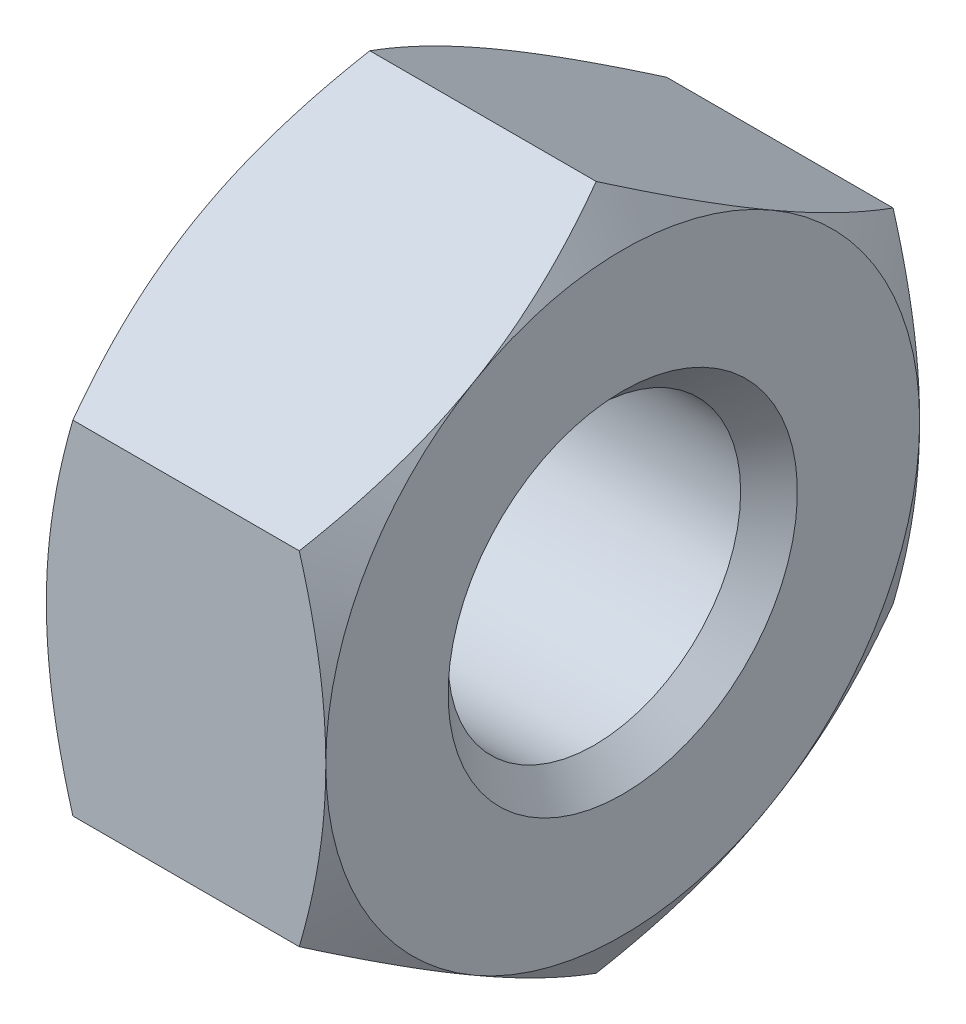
ISO-10303-21;
HEADER;
FILE_DESCRIPTION(('STEP AP214'),'2;1');
FILE_NAME('part.step','',(''),(''),'','','');
FILE_SCHEMA(('AUTOMOTIVE_DESIGN { 1 0 10303 214 1 1 1 1 }'));
ENDSEC;
DATA;
#1=APPLICATION_CONTEXT('core data for automotive mechanical design processes');
#2=APPLICATION_PROTOCOL_DEFINITION('international standard','automotive_design',2000,#1);
#3=PRODUCT_CONTEXT('',#1,'mechanical');
#4=PRODUCT('Part','Part','',(#3));
#5=PRODUCT_RELATED_PRODUCT_CATEGORY('part','',(#4));
#6=PRODUCT_DEFINITION_FORMATION('','',#4);
#7=PRODUCT_DEFINITION_CONTEXT('part definition',#1,'design');
#8=PRODUCT_DEFINITION('design','',#6,#7);
#9=PRODUCT_DEFINITION_SHAPE('','',#8);
#10=(LENGTH_UNIT() NAMED_UNIT(*) SI_UNIT(.MILLI.,.METRE.));
#11=(NAMED_UNIT(*) PLANE_ANGLE_UNIT() SI_UNIT($,.RADIAN.));
#12=(NAMED_UNIT(*) SI_UNIT($,.STERADIAN.) SOLID_ANGLE_UNIT());
#13=UNCERTAINTY_MEASURE_WITH_UNIT(LENGTH_MEASURE(1.E-05),#10,'distance_accuracy_value','');
#14=(GEOMETRIC_REPRESENTATION_CONTEXT(3) GLOBAL_UNCERTAINTY_ASSIGNED_CONTEXT((#13)) GLOBAL_UNIT_ASSIGNED_CONTEXT((#10,
#11,#12)) REPRESENTATION_CONTEXT('',''));
#15=CARTESIAN_POINT('',(0.,0.,0.));
#16=DIRECTION('',(0.,0.,1.));
#17=DIRECTION('',(1.,0.,0.));
#18=AXIS2_PLACEMENT_3D('',#15,#16,#17);
#19=DIRECTION('',(-0.707106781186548,0.707106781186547,0.));
#20=VECTOR('',#19,1.);
#21=CARTESIAN_POINT('',(-498995.,499000.,0.));
#22=LINE('',#21,#20);
#23=CARTESIAN_POINT('',(5.,0.,0.));
#24=DIRECTION('',(-1.,0.,0.));
#25=AXIS1_PLACEMENT('',#23,#24);
#26=SURFACE_OF_REVOLUTION('',#22,#25);
#27=CARTESIAN_POINT('',(0.812000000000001,0.,0.));
#28=DIRECTION('',(-1.,0.,0.));
#29=DIRECTION('',(0.,1.,0.));
#30=AXIS2_PLACEMENT_3D('',#27,#28,#29);
#31=CIRCLE('',#30,4.188);
#32=CARTESIAN_POINT('',(0.812000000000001,4.188,0.));
#33=VERTEX_POINT('',#32);
#34=EDGE_CURVE('E425',#33,#33,#31,.T.);
#35=ORIENTED_EDGE('',*,*,#34,.F.);
#36=EDGE_LOOP('',(#35));
#37=FACE_BOUND('',#36,.T.);
#38=CARTESIAN_POINT('',(0.,0.,0.));
#39=DIRECTION('',(-1.,0.,0.));
#40=DIRECTION('',(0.,1.,0.));
#41=AXIS2_PLACEMENT_3D('',#38,#39,#40);
#42=CIRCLE('',#41,5.);
#43=CARTESIAN_POINT('',(0.,5.,0.));
#44=VERTEX_POINT('',#43);
#45=EDGE_CURVE('E458',#44,#44,#42,.T.);
#46=ORIENTED_EDGE('',*,*,#45,.T.);
#47=EDGE_LOOP('',(#46));
#48=FACE_BOUND('',#47,.T.);
#49=ADVANCED_FACE('F16',(#37,#48),#26,.F.);
#50=CARTESIAN_POINT('',(0.,6.75,0.));
#51=DIRECTION('',(-1.,0.,0.));
#52=DIRECTION('',(0.,-1.,0.));
#53=AXIS2_PLACEMENT_3D('',#50,#51,#52);
#54=PLANE('',#53);
#55=CARTESIAN_POINT('',(0.,0.,0.));
#56=DIRECTION('',(-1.,0.,0.));
#57=DIRECTION('',(0.,1.,0.));
#58=AXIS2_PLACEMENT_3D('',#55,#56,#57);
#59=CIRCLE('',#58,8.5);
#60=CARTESIAN_POINT('',(0.,7.36121593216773,4.25));
#61=VERTEX_POINT('',#60);
#62=CARTESIAN_POINT('',(0.,7.36121593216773,-4.25));
#63=VERTEX_POINT('',#62);
#64=EDGE_CURVE('E11',#61,#63,#59,.T.);
#65=ORIENTED_EDGE('',*,*,#64,.T.);
#66=CARTESIAN_POINT('',(0.,0.,0.));
#67=DIRECTION('',(-1.,0.,0.));
#68=DIRECTION('',(0.,1.,0.));
#69=AXIS2_PLACEMENT_3D('',#66,#67,#68);
#70=CIRCLE('',#69,8.5);
#71=CARTESIAN_POINT('',(0.,0.,-8.5));
#72=VERTEX_POINT('',#71);
#73=EDGE_CURVE('E26',#63,#72,#70,.T.);
#74=ORIENTED_EDGE('',*,*,#73,.T.);
#75=CARTESIAN_POINT('',(0.,0.,0.));
#76=DIRECTION('',(-1.,0.,0.));
#77=DIRECTION('',(0.,1.,0.));
#78=AXIS2_PLACEMENT_3D('',#75,#76,#77);
#79=CIRCLE('',#78,8.5);
#80=CARTESIAN_POINT('',(0.,-7.36121593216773,-4.25));
#81=VERTEX_POINT('',#80);
#82=EDGE_CURVE('E160',#72,#81,#79,.T.);
#83=ORIENTED_EDGE('',*,*,#82,.T.);
#84=CARTESIAN_POINT('',(0.,0.,0.));
#85=DIRECTION('',(-1.,0.,0.));
#86=DIRECTION('',(0.,1.,0.));
#87=AXIS2_PLACEMENT_3D('',#84,#85,#86);
#88=CIRCLE('',#87,8.5);
#89=CARTESIAN_POINT('',(0.,-7.36121593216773,4.25));
#90=VERTEX_POINT('',#89);
#91=EDGE_CURVE('E362',#81,#90,#88,.T.);
#92=ORIENTED_EDGE('',*,*,#91,.T.);
#93=CARTESIAN_POINT('',(0.,0.,0.));
#94=DIRECTION('',(-1.,0.,0.));
#95=DIRECTION('',(0.,1.,0.));
#96=AXIS2_PLACEMENT_3D('',#93,#94,#95);
#97=CIRCLE('',#96,8.5);
#98=CARTESIAN_POINT('',(0.,0.,8.5));
#99=VERTEX_POINT('',#98);
#100=EDGE_CURVE('E365',#90,#99,#97,.T.);
#101=ORIENTED_EDGE('',*,*,#100,.T.);
#102=CARTESIAN_POINT('',(0.,0.,0.));
#103=DIRECTION('',(-1.,0.,0.));
#104=DIRECTION('',(0.,1.,0.));
#105=AXIS2_PLACEMENT_3D('',#102,#103,#104);
#106=CIRCLE('',#105,8.5);
#107=EDGE_CURVE('E361',#99,#61,#106,.T.);
#108=ORIENTED_EDGE('',*,*,#107,.T.);
#109=EDGE_LOOP('',(#65,#74,#83,#92,#101,#108));
#110=FACE_BOUND('',#109,.T.);
#111=ORIENTED_EDGE('',*,*,#45,.F.);
#112=EDGE_LOOP('',(#111));
#113=FACE_BOUND('',#112,.T.);
#114=ADVANCED_FACE('F179',(#110,#113),#54,.T.);
#115=CARTESIAN_POINT('',(8.,6.75,0.));
#116=DIRECTION('',(1.,0.,0.));
#117=DIRECTION('',(0.,0.,-1.));
#118=AXIS2_PLACEMENT_3D('',#115,#116,#117);
#119=PLANE('',#118);
#120=CARTESIAN_POINT('',(8.,0.,0.));
#121=DIRECTION('',(-1.,0.,0.));
#122=DIRECTION('',(0.,1.,0.));
#123=AXIS2_PLACEMENT_3D('',#120,#121,#122);
#124=CIRCLE('',#123,5.);
#125=CARTESIAN_POINT('',(8.,5.,0.));
#126=VERTEX_POINT('',#125);
#127=EDGE_CURVE('E355',#126,#126,#124,.T.);
#128=ORIENTED_EDGE('',*,*,#127,.T.);
#129=EDGE_LOOP('',(#128));
#130=FACE_BOUND('',#129,.T.);
#131=CARTESIAN_POINT('',(8.,0.,0.));
#132=DIRECTION('',(-1.,0.,0.));
#133=DIRECTION('',(0.,1.,0.));
#134=AXIS2_PLACEMENT_3D('',#131,#132,#133);
#135=CIRCLE('',#134,8.5);
#136=CARTESIAN_POINT('',(8.,7.36121593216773,4.25));
#137=VERTEX_POINT('',#136);
#138=CARTESIAN_POINT('',(8.,7.36121593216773,-4.25));
#139=VERTEX_POINT('',#138);
#140=EDGE_CURVE('E371',#137,#139,#135,.T.);
#141=ORIENTED_EDGE('',*,*,#140,.F.);
#142=CARTESIAN_POINT('',(8.,0.,0.));
#143=DIRECTION('',(-1.,0.,0.));
#144=DIRECTION('',(0.,1.,0.));
#145=AXIS2_PLACEMENT_3D('',#142,#143,#144);
#146=CIRCLE('',#145,8.5);
#147=CARTESIAN_POINT('',(8.,0.,8.5));
#148=VERTEX_POINT('',#147);
#149=EDGE_CURVE('E407',#148,#137,#146,.T.);
#150=ORIENTED_EDGE('',*,*,#149,.F.);
#151=CARTESIAN_POINT('',(8.,0.,0.));
#152=DIRECTION('',(-1.,0.,0.));
#153=DIRECTION('',(0.,1.,0.));
#154=AXIS2_PLACEMENT_3D('',#151,#152,#153);
#155=CIRCLE('',#154,8.5);
#156=CARTESIAN_POINT('',(8.,-7.36121593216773,4.25));
#157=VERTEX_POINT('',#156);
#158=EDGE_CURVE('E130',#157,#148,#155,.T.);
#159=ORIENTED_EDGE('',*,*,#158,.F.);
#160=CARTESIAN_POINT('',(8.,0.,0.));
#161=DIRECTION('',(-1.,0.,0.));
#162=DIRECTION('',(0.,1.,0.));
#163=AXIS2_PLACEMENT_3D('',#160,#161,#162);
#164=CIRCLE('',#163,8.5);
#165=CARTESIAN_POINT('',(8.,-7.36121593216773,-4.25));
#166=VERTEX_POINT('',#165);
#167=EDGE_CURVE('E104',#166,#157,#164,.T.);
#168=ORIENTED_EDGE('',*,*,#167,.F.);
#169=CARTESIAN_POINT('',(8.,0.,0.));
#170=DIRECTION('',(-1.,0.,0.));
#171=DIRECTION('',(0.,1.,0.));
#172=AXIS2_PLACEMENT_3D('',#169,#170,#171);
#173=CIRCLE('',#172,8.5);
#174=CARTESIAN_POINT('',(8.,0.,-8.5));
#175=VERTEX_POINT('',#174);
#176=EDGE_CURVE('E119',#175,#166,#173,.T.);
#177=ORIENTED_EDGE('',*,*,#176,.F.);
#178=CARTESIAN_POINT('',(8.,0.,0.));
#179=DIRECTION('',(-1.,0.,0.));
#180=DIRECTION('',(0.,1.,0.));
#181=AXIS2_PLACEMENT_3D('',#178,#179,#180);
#182=CIRCLE('',#181,8.5);
#183=EDGE_CURVE('E426',#139,#175,#182,.T.);
#184=ORIENTED_EDGE('',*,*,#183,.F.);
#185=EDGE_LOOP('',(#141,#150,#159,#168,#177,#184));
#186=FACE_BOUND('',#185,.T.);
#187=ADVANCED_FACE('F127',(#130,#186),#119,.T.);
#188=DIRECTION('',(0.707106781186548,0.707106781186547,0.));
#189=VECTOR('',#188,1.);
#190=CARTESIAN_POINT('',(499000.,498996.999999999,0.));
#191=LINE('',#190,#189);
#192=CARTESIAN_POINT('',(2.99999999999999,0.,0.));
#193=DIRECTION('',(1.,0.,0.));
#194=AXIS1_PLACEMENT('',#192,#193);
#195=SURFACE_OF_REVOLUTION('',#191,#194);
#196=ORIENTED_EDGE('',*,*,#127,.F.);
#197=EDGE_LOOP('',(#196));
#198=FACE_BOUND('',#197,.T.);
#199=CARTESIAN_POINT('',(7.188,0.,0.));
#200=DIRECTION('',(-1.,0.,0.));
#201=DIRECTION('',(0.,1.,0.));
#202=AXIS2_PLACEMENT_3D('',#199,#200,#201);
#203=CIRCLE('',#202,4.188);
#204=CARTESIAN_POINT('',(7.188,4.188,0.));
#205=VERTEX_POINT('',#204);
#206=EDGE_CURVE('E154',#205,#205,#203,.T.);
#207=ORIENTED_EDGE('',*,*,#206,.T.);
#208=EDGE_LOOP('',(#207));
#209=FACE_BOUND('',#208,.T.);
#210=ADVANCED_FACE('F186',(#198,#209),#195,.F.);
#211=CARTESIAN_POINT('',(4.,0.,0.));
#212=DIRECTION('',(1.,0.,0.));
#213=DIRECTION('',(0.,1.,0.));
#214=AXIS2_PLACEMENT_3D('',#211,#212,#213);
#215=CIRCLE('',#214,4.188);
#216=DIRECTION('',(-1.,0.,0.));
#217=VECTOR('',#216,1.);
#218=SURFACE_OF_LINEAR_EXTRUSION('',#215,#217);
#219=ORIENTED_EDGE('',*,*,#206,.F.);
#220=EDGE_LOOP('',(#219));
#221=FACE_BOUND('',#220,.T.);
#222=ORIENTED_EDGE('',*,*,#34,.T.);
#223=EDGE_LOOP('',(#222));
#224=FACE_BOUND('',#223,.T.);
#225=ADVANCED_FACE('F190',(#221,#224),#218,.T.);
#226=DIRECTION('',(0.5,-0.866025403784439,0.));
#227=VECTOR('',#226,1.);
#228=CARTESIAN_POINT('',(6.,11.9641016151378,0.));
#229=LINE('',#228,#227);
#230=CARTESIAN_POINT('',(12.9074772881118,0.,0.));
#231=DIRECTION('',(-1.,0.,0.));
#232=AXIS1_PLACEMENT('',#230,#231);
#233=SURFACE_OF_REVOLUTION('',#229,#232);
#234=CARTESIAN_POINT('',(8.,7.36121593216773,4.25));
#235=CARTESIAN_POINT('',(8.,6.22243186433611,6.22243186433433));
#236=CARTESIAN_POINT('',(7.24081062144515,4.90747728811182,8.5));
#237=(BOUNDED_CURVE() B_SPLINE_CURVE(2,(#234,#235,#236),.UNSPECIFIED.,.F.,
.F.) B_SPLINE_CURVE_WITH_KNOTS((3,3),(13.5657361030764,19.7429184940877),
.UNSPECIFIED.) CURVE() GEOMETRIC_REPRESENTATION_ITEM() RATIONAL_B_SPLINE_CURVE((1.,
1.08487688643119,1.09245608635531)) REPRESENTATION_ITEM(''));
#238=CARTESIAN_POINT('',(7.24081062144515,4.90747728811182,8.5));
#239=VERTEX_POINT('',#238);
#240=EDGE_CURVE('E146',#137,#239,#237,.T.);
#241=ORIENTED_EDGE('',*,*,#240,.T.);
#242=CARTESIAN_POINT('',(7.24081062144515,4.90747728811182,8.5));
#243=CARTESIAN_POINT('',(8.,2.27756813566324,8.5));
#244=CARTESIAN_POINT('',(8.,0.,8.5));
#245=(BOUNDED_CURVE() B_SPLINE_CURVE(2,(#242,#243,#244),.UNSPECIFIED.,.F.,
.F.) B_SPLINE_CURVE_WITH_KNOTS((3,3),(7.38855371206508,13.5657361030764),
.UNSPECIFIED.) CURVE() GEOMETRIC_REPRESENTATION_ITEM() RATIONAL_B_SPLINE_CURVE((1.09245608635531,
1.08487688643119,1.)) REPRESENTATION_ITEM(''));
#246=EDGE_CURVE('E137',#239,#148,#245,.T.);
#247=ORIENTED_EDGE('',*,*,#246,.T.);
#248=ORIENTED_EDGE('',*,*,#149,.T.);
#249=EDGE_LOOP('',(#241,#247,#248));
#250=FACE_BOUND('',#249,.T.);
#251=ADVANCED_FACE('F194',(#250),#233,.F.);
#252=DIRECTION('',(0.5,-0.866025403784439,0.));
#253=VECTOR('',#252,1.);
#254=CARTESIAN_POINT('',(6.,11.9641016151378,0.));
#255=LINE('',#254,#253);
#256=CARTESIAN_POINT('',(12.9074772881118,0.,0.));
#257=DIRECTION('',(-1.,0.,0.));
#258=AXIS1_PLACEMENT('',#256,#257);
#259=SURFACE_OF_REVOLUTION('',#255,#258);
#260=CARTESIAN_POINT('',(8.,7.36121593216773,-4.25));
#261=CARTESIAN_POINT('',(8.,8.49999999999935,-2.27756813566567));
#262=CARTESIAN_POINT('',(7.24081062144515,9.81495457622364,0.));
#263=(BOUNDED_CURVE() B_SPLINE_CURVE(2,(#260,#261,#262),.UNSPECIFIED.,.F.,
.F.) B_SPLINE_CURVE_WITH_KNOTS((3,3),(13.5657361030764,19.7429184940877),
.UNSPECIFIED.) CURVE() GEOMETRIC_REPRESENTATION_ITEM() RATIONAL_B_SPLINE_CURVE((1.,
1.08487688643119,1.09245608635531)) REPRESENTATION_ITEM(''));
#264=CARTESIAN_POINT('',(7.24081062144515,9.81495457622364,0.));
#265=VERTEX_POINT('',#264);
#266=EDGE_CURVE('E383',#139,#265,#263,.T.);
#267=ORIENTED_EDGE('',*,*,#266,.T.);
#268=CARTESIAN_POINT('',(7.24081062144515,9.81495457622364,0.));
#269=CARTESIAN_POINT('',(8.,8.49999999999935,2.27756813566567));
#270=CARTESIAN_POINT('',(8.,7.36121593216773,4.25));
#271=(BOUNDED_CURVE() B_SPLINE_CURVE(2,(#268,#269,#270),.UNSPECIFIED.,.F.,
.F.) B_SPLINE_CURVE_WITH_KNOTS((3,3),(7.38855371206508,13.5657361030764),
.UNSPECIFIED.) CURVE() GEOMETRIC_REPRESENTATION_ITEM() RATIONAL_B_SPLINE_CURVE((1.09245608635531,
1.08487688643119,1.)) REPRESENTATION_ITEM(''));
#272=EDGE_CURVE('E379',#265,#137,#271,.T.);
#273=ORIENTED_EDGE('',*,*,#272,.T.);
#274=ORIENTED_EDGE('',*,*,#140,.T.);
#275=EDGE_LOOP('',(#267,#273,#274));
#276=FACE_BOUND('',#275,.T.);
#277=ADVANCED_FACE('F205',(#276),#259,.F.);
#278=DIRECTION('',(0.5,-0.866025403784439,0.));
#279=VECTOR('',#278,1.);
#280=CARTESIAN_POINT('',(6.,11.9641016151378,0.));
#281=LINE('',#280,#279);
#282=CARTESIAN_POINT('',(12.9074772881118,0.,0.));
#283=DIRECTION('',(-1.,0.,0.));
#284=AXIS1_PLACEMENT('',#282,#283);
#285=SURFACE_OF_REVOLUTION('',#281,#284);
#286=CARTESIAN_POINT('',(8.,0.,-8.5));
#287=CARTESIAN_POINT('',(8.,2.27756813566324,-8.5));
#288=CARTESIAN_POINT('',(7.24081062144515,4.90747728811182,-8.5));
#289=(BOUNDED_CURVE() B_SPLINE_CURVE(2,(#286,#287,#288),.UNSPECIFIED.,.F.,
.F.) B_SPLINE_CURVE_WITH_KNOTS((3,3),(13.5657361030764,19.7429184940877),
.UNSPECIFIED.) CURVE() GEOMETRIC_REPRESENTATION_ITEM() RATIONAL_B_SPLINE_CURVE((1.,
1.08487688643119,1.09245608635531)) REPRESENTATION_ITEM(''));
#290=CARTESIAN_POINT('',(7.24081062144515,4.90747728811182,-8.5));
#291=VERTEX_POINT('',#290);
#292=EDGE_CURVE('E366',#175,#291,#289,.T.);
#293=ORIENTED_EDGE('',*,*,#292,.T.);
#294=CARTESIAN_POINT('',(7.24081062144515,4.90747728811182,-8.5));
#295=CARTESIAN_POINT('',(8.,6.22243186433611,-6.22243186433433));
#296=CARTESIAN_POINT('',(8.,7.36121593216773,-4.25));
#297=(BOUNDED_CURVE() B_SPLINE_CURVE(2,(#294,#295,#296),.UNSPECIFIED.,.F.,
.F.) B_SPLINE_CURVE_WITH_KNOTS((3,3),(7.38855371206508,13.5657361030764),
.UNSPECIFIED.) CURVE() GEOMETRIC_REPRESENTATION_ITEM() RATIONAL_B_SPLINE_CURVE((1.09245608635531,
1.08487688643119,1.)) REPRESENTATION_ITEM(''));
#298=EDGE_CURVE('E298',#291,#139,#297,.T.);
#299=ORIENTED_EDGE('',*,*,#298,.T.);
#300=ORIENTED_EDGE('',*,*,#183,.T.);
#301=EDGE_LOOP('',(#293,#299,#300));
#302=FACE_BOUND('',#301,.T.);
#303=ADVANCED_FACE('F208',(#302),#285,.F.);
#304=DIRECTION('',(0.5,-0.866025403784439,0.));
#305=VECTOR('',#304,1.);
#306=CARTESIAN_POINT('',(6.,11.9641016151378,0.));
#307=LINE('',#306,#305);
#308=CARTESIAN_POINT('',(12.9074772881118,0.,0.));
#309=DIRECTION('',(-1.,0.,0.));
#310=AXIS1_PLACEMENT('',#308,#309);
#311=SURFACE_OF_REVOLUTION('',#307,#310);
#312=CARTESIAN_POINT('',(7.24081062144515,-4.90747728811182,-8.5));
#313=CARTESIAN_POINT('',(8.,-2.27756813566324,-8.5));
#314=CARTESIAN_POINT('',(8.,0.,-8.5));
#315=(BOUNDED_CURVE() B_SPLINE_CURVE(2,(#312,#313,#314),.UNSPECIFIED.,.F.,
.F.) B_SPLINE_CURVE_WITH_KNOTS((3,3),(7.38855371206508,13.5657361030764),
.UNSPECIFIED.) CURVE() GEOMETRIC_REPRESENTATION_ITEM() RATIONAL_B_SPLINE_CURVE((1.09245608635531,
1.08487688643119,1.)) REPRESENTATION_ITEM(''));
#316=CARTESIAN_POINT('',(7.24081062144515,-4.90747728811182,-8.5));
#317=VERTEX_POINT('',#316);
#318=EDGE_CURVE('E123',#317,#175,#315,.T.);
#319=ORIENTED_EDGE('',*,*,#318,.T.);
#320=ORIENTED_EDGE('',*,*,#176,.T.);
#321=CARTESIAN_POINT('',(8.,-7.36121593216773,-4.25));
#322=CARTESIAN_POINT('',(8.,-6.22243186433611,-6.22243186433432));
#323=CARTESIAN_POINT('',(7.24081062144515,-4.90747728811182,-8.5));
#324=(BOUNDED_CURVE() B_SPLINE_CURVE(2,(#321,#322,#323),.UNSPECIFIED.,.F.,
.F.) B_SPLINE_CURVE_WITH_KNOTS((3,3),(13.5657361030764,19.7429184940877),
.UNSPECIFIED.) CURVE() GEOMETRIC_REPRESENTATION_ITEM() RATIONAL_B_SPLINE_CURVE((1.,
1.08487688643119,1.09245608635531)) REPRESENTATION_ITEM(''));
#325=EDGE_CURVE('E110',#166,#317,#324,.T.);
#326=ORIENTED_EDGE('',*,*,#325,.T.);
#327=EDGE_LOOP('',(#319,#320,#326));
#328=FACE_BOUND('',#327,.T.);
#329=ADVANCED_FACE('F122',(#328),#311,.F.);
#330=DIRECTION('',(0.5,-0.866025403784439,0.));
#331=VECTOR('',#330,1.);
#332=CARTESIAN_POINT('',(6.,11.9641016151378,0.));
#333=LINE('',#332,#331);
#334=CARTESIAN_POINT('',(12.9074772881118,0.,0.));
#335=DIRECTION('',(-1.,0.,0.));
#336=AXIS1_PLACEMENT('',#334,#335);
#337=SURFACE_OF_REVOLUTION('',#333,#336);
#338=CARTESIAN_POINT('',(7.24081062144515,-9.81495457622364,0.));
#339=CARTESIAN_POINT('',(8.,-8.49999999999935,-2.27756813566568));
#340=CARTESIAN_POINT('',(8.,-7.36121593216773,-4.25));
#341=(BOUNDED_CURVE() B_SPLINE_CURVE(2,(#338,#339,#340),.UNSPECIFIED.,.F.,
.F.) B_SPLINE_CURVE_WITH_KNOTS((3,3),(7.38855371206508,13.5657361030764),
.UNSPECIFIED.) CURVE() GEOMETRIC_REPRESENTATION_ITEM() RATIONAL_B_SPLINE_CURVE((1.09245608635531,
1.08487688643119,1.)) REPRESENTATION_ITEM(''));
#342=CARTESIAN_POINT('',(7.24081062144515,-9.81495457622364,0.));
#343=VERTEX_POINT('',#342);
#344=EDGE_CURVE('E100',#343,#166,#341,.T.);
#345=ORIENTED_EDGE('',*,*,#344,.T.);
#346=ORIENTED_EDGE('',*,*,#167,.T.);
#347=CARTESIAN_POINT('',(8.,-7.36121593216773,4.25));
#348=CARTESIAN_POINT('',(8.,-8.49999999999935,2.27756813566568));
#349=CARTESIAN_POINT('',(7.24081062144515,-9.81495457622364,0.));
#350=(BOUNDED_CURVE() B_SPLINE_CURVE(2,(#347,#348,#349),.UNSPECIFIED.,.F.,
.F.) B_SPLINE_CURVE_WITH_KNOTS((3,3),(13.5657361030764,19.7429184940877),
.UNSPECIFIED.) CURVE() GEOMETRIC_REPRESENTATION_ITEM() RATIONAL_B_SPLINE_CURVE((1.,
1.08487688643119,1.09245608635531)) REPRESENTATION_ITEM(''));
#351=EDGE_CURVE('E106',#157,#343,#350,.T.);
#352=ORIENTED_EDGE('',*,*,#351,.T.);
#353=EDGE_LOOP('',(#345,#346,#352));
#354=FACE_BOUND('',#353,.T.);
#355=ADVANCED_FACE('F102',(#354),#337,.F.);
#356=DIRECTION('',(0.5,-0.866025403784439,0.));
#357=VECTOR('',#356,1.);
#358=CARTESIAN_POINT('',(6.,11.9641016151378,0.));
#359=LINE('',#358,#357);
#360=CARTESIAN_POINT('',(12.9074772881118,0.,0.));
#361=DIRECTION('',(-1.,0.,0.));
#362=AXIS1_PLACEMENT('',#360,#361);
#363=SURFACE_OF_REVOLUTION('',#359,#362);
#364=CARTESIAN_POINT('',(7.24081062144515,-4.90747728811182,8.5));
#365=CARTESIAN_POINT('',(8.,-6.22243186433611,6.22243186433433));
#366=CARTESIAN_POINT('',(8.,-7.36121593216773,4.25));
#367=(BOUNDED_CURVE() B_SPLINE_CURVE(2,(#364,#365,#366),.UNSPECIFIED.,.F.,
.F.) B_SPLINE_CURVE_WITH_KNOTS((3,3),(7.38855371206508,13.5657361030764),
.UNSPECIFIED.) CURVE() GEOMETRIC_REPRESENTATION_ITEM() RATIONAL_B_SPLINE_CURVE((1.09245608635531,
1.08487688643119,1.)) REPRESENTATION_ITEM(''));
#368=CARTESIAN_POINT('',(7.24081062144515,-4.90747728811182,8.5));
#369=VERTEX_POINT('',#368);
#370=EDGE_CURVE('E133',#369,#157,#367,.T.);
#371=ORIENTED_EDGE('',*,*,#370,.T.);
#372=ORIENTED_EDGE('',*,*,#158,.T.);
#373=CARTESIAN_POINT('',(8.,0.,8.5));
#374=CARTESIAN_POINT('',(8.,-2.27756813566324,8.5));
#375=CARTESIAN_POINT('',(7.24081062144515,-4.90747728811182,8.5));
#376=(BOUNDED_CURVE() B_SPLINE_CURVE(2,(#373,#374,#375),.UNSPECIFIED.,.F.,
.F.) B_SPLINE_CURVE_WITH_KNOTS((3,3),(13.5657361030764,19.7429184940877),
.UNSPECIFIED.) CURVE() GEOMETRIC_REPRESENTATION_ITEM() RATIONAL_B_SPLINE_CURVE((1.,
1.08487688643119,1.09245608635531)) REPRESENTATION_ITEM(''));
#377=EDGE_CURVE('E334',#148,#369,#376,.T.);
#378=ORIENTED_EDGE('',*,*,#377,.T.);
#379=EDGE_LOOP('',(#371,#372,#378));
#380=FACE_BOUND('',#379,.T.);
#381=ADVANCED_FACE('F224',(#380),#363,.F.);
#382=DIRECTION('',(-0.5,-0.866025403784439,0.));
#383=VECTOR('',#382,1.);
#384=CARTESIAN_POINT('',(2.,11.9641016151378,0.));
#385=LINE('',#384,#383);
#386=CARTESIAN_POINT('',(-4.90747728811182,0.,0.));
#387=DIRECTION('',(1.,0.,0.));
#388=AXIS1_PLACEMENT('',#386,#387);
#389=SURFACE_OF_REVOLUTION('',#385,#388);
#390=CARTESIAN_POINT('',(0.,7.36121593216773,4.25));
#391=CARTESIAN_POINT('',(0.,8.49999999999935,2.27756813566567));
#392=CARTESIAN_POINT('',(0.759189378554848,9.81495457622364,0.));
#393=(BOUNDED_CURVE() B_SPLINE_CURVE(2,(#390,#391,#392),.UNSPECIFIED.,.F.,
.F.) B_SPLINE_CURVE_WITH_KNOTS((3,3),(13.5657361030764,19.7429184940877),
.UNSPECIFIED.) CURVE() GEOMETRIC_REPRESENTATION_ITEM() RATIONAL_B_SPLINE_CURVE((1.,
1.08487688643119,1.09245608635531)) REPRESENTATION_ITEM(''));
#394=CARTESIAN_POINT('',(0.759189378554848,9.81495457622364,0.));
#395=VERTEX_POINT('',#394);
#396=EDGE_CURVE('E283',#61,#395,#393,.T.);
#397=ORIENTED_EDGE('',*,*,#396,.T.);
#398=CARTESIAN_POINT('',(0.759189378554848,9.81495457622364,0.));
#399=CARTESIAN_POINT('',(0.,8.49999999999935,-2.27756813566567));
#400=CARTESIAN_POINT('',(0.,7.36121593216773,-4.25));
#401=(BOUNDED_CURVE() B_SPLINE_CURVE(2,(#398,#399,#400),.UNSPECIFIED.,.F.,
.F.) B_SPLINE_CURVE_WITH_KNOTS((3,3),(7.38855371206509,13.5657361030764),
.UNSPECIFIED.) CURVE() GEOMETRIC_REPRESENTATION_ITEM() RATIONAL_B_SPLINE_CURVE((1.09245608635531,
1.08487688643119,1.)) REPRESENTATION_ITEM(''));
#402=EDGE_CURVE('E290',#395,#63,#401,.T.);
#403=ORIENTED_EDGE('',*,*,#402,.T.);
#404=ORIENTED_EDGE('',*,*,#64,.F.);
#405=EDGE_LOOP('',(#397,#403,#404));
#406=FACE_BOUND('',#405,.T.);
#407=ADVANCED_FACE('F227',(#406),#389,.F.);
#408=DIRECTION('',(-0.5,-0.866025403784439,0.));
#409=VECTOR('',#408,1.);
#410=CARTESIAN_POINT('',(2.,11.9641016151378,0.));
#411=LINE('',#410,#409);
#412=CARTESIAN_POINT('',(-4.90747728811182,0.,0.));
#413=DIRECTION('',(1.,0.,0.));
#414=AXIS1_PLACEMENT('',#412,#413);
#415=SURFACE_OF_REVOLUTION('',#411,#414);
#416=CARTESIAN_POINT('',(0.,0.,8.5));
#417=CARTESIAN_POINT('',(0.,2.27756813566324,8.5));
#418=CARTESIAN_POINT('',(0.759189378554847,4.90747728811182,8.5));
#419=(BOUNDED_CURVE() B_SPLINE_CURVE(2,(#416,#417,#418),.UNSPECIFIED.,.F.,
.F.) B_SPLINE_CURVE_WITH_KNOTS((3,3),(13.5657361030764,19.7429184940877),
.UNSPECIFIED.) CURVE() GEOMETRIC_REPRESENTATION_ITEM() RATIONAL_B_SPLINE_CURVE((1.,
1.08487688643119,1.09245608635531)) REPRESENTATION_ITEM(''));
#420=CARTESIAN_POINT('',(0.759189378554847,4.90747728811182,8.5));
#421=VERTEX_POINT('',#420);
#422=EDGE_CURVE('E287',#99,#421,#419,.T.);
#423=ORIENTED_EDGE('',*,*,#422,.T.);
#424=CARTESIAN_POINT('',(0.759189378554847,4.90747728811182,8.5));
#425=CARTESIAN_POINT('',(0.,6.22243186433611,6.22243186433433));
#426=CARTESIAN_POINT('',(0.,7.36121593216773,4.25));
#427=(BOUNDED_CURVE() B_SPLINE_CURVE(2,(#424,#425,#426),.UNSPECIFIED.,.F.,
.F.) B_SPLINE_CURVE_WITH_KNOTS((3,3),(7.38855371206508,13.5657361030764),
.UNSPECIFIED.) CURVE() GEOMETRIC_REPRESENTATION_ITEM() RATIONAL_B_SPLINE_CURVE((1.09245608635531,
1.08487688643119,1.)) REPRESENTATION_ITEM(''));
#428=EDGE_CURVE('E278',#421,#61,#427,.T.);
#429=ORIENTED_EDGE('',*,*,#428,.T.);
#430=ORIENTED_EDGE('',*,*,#107,.F.);
#431=EDGE_LOOP('',(#423,#429,#430));
#432=FACE_BOUND('',#431,.T.);
#433=ADVANCED_FACE('F231',(#432),#415,.F.);
#434=DIRECTION('',(-0.5,-0.866025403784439,0.));
#435=VECTOR('',#434,1.);
#436=CARTESIAN_POINT('',(2.,11.9641016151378,0.));
#437=LINE('',#436,#435);
#438=CARTESIAN_POINT('',(-4.90747728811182,0.,0.));
#439=DIRECTION('',(1.,0.,0.));
#440=AXIS1_PLACEMENT('',#438,#439);
#441=SURFACE_OF_REVOLUTION('',#437,#440);
#442=CARTESIAN_POINT('',(0.,-7.36121593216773,4.25));
#443=CARTESIAN_POINT('',(0.,-6.22243186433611,6.22243186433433));
#444=CARTESIAN_POINT('',(0.759189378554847,-4.90747728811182,8.5));
#445=(BOUNDED_CURVE() B_SPLINE_CURVE(2,(#442,#443,#444),.UNSPECIFIED.,.F.,
.F.) B_SPLINE_CURVE_WITH_KNOTS((3,3),(13.5657361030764,19.7429184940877),
.UNSPECIFIED.) CURVE() GEOMETRIC_REPRESENTATION_ITEM() RATIONAL_B_SPLINE_CURVE((1.,
1.08487688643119,1.09245608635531)) REPRESENTATION_ITEM(''));
#446=CARTESIAN_POINT('',(0.759189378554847,-4.90747728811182,8.5));
#447=VERTEX_POINT('',#446);
#448=EDGE_CURVE('E288',#90,#447,#445,.T.);
#449=ORIENTED_EDGE('',*,*,#448,.T.);
#450=CARTESIAN_POINT('',(0.759189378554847,-4.90747728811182,8.5));
#451=CARTESIAN_POINT('',(0.,-2.27756813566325,8.5));
#452=CARTESIAN_POINT('',(0.,0.,8.5));
#453=(BOUNDED_CURVE() B_SPLINE_CURVE(2,(#450,#451,#452),.UNSPECIFIED.,.F.,
.F.) B_SPLINE_CURVE_WITH_KNOTS((3,3),(7.38855371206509,13.5657361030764),
.UNSPECIFIED.) CURVE() GEOMETRIC_REPRESENTATION_ITEM() RATIONAL_B_SPLINE_CURVE((1.09245608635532,
1.08487688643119,1.)) REPRESENTATION_ITEM(''));
#454=EDGE_CURVE('E293',#447,#99,#453,.T.);
#455=ORIENTED_EDGE('',*,*,#454,.T.);
#456=ORIENTED_EDGE('',*,*,#100,.F.);
#457=EDGE_LOOP('',(#449,#455,#456));
#458=FACE_BOUND('',#457,.T.);
#459=ADVANCED_FACE('F235',(#458),#441,.F.);
#460=DIRECTION('',(-0.5,-0.866025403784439,0.));
#461=VECTOR('',#460,1.);
#462=CARTESIAN_POINT('',(2.,11.9641016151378,0.));
#463=LINE('',#462,#461);
#464=CARTESIAN_POINT('',(-4.90747728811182,0.,0.));
#465=DIRECTION('',(1.,0.,0.));
#466=AXIS1_PLACEMENT('',#464,#465);
#467=SURFACE_OF_REVOLUTION('',#463,#466);
#468=CARTESIAN_POINT('',(0.759189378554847,-9.81495457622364,0.));
#469=CARTESIAN_POINT('',(0.,-8.49999999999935,2.27756813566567));
#470=CARTESIAN_POINT('',(0.,-7.36121593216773,4.25));
#471=(BOUNDED_CURVE() B_SPLINE_CURVE(2,(#468,#469,#470),.UNSPECIFIED.,.F.,
.F.) B_SPLINE_CURVE_WITH_KNOTS((3,3),(7.38855371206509,13.5657361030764),
.UNSPECIFIED.) CURVE() GEOMETRIC_REPRESENTATION_ITEM() RATIONAL_B_SPLINE_CURVE((1.09245608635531,
1.08487688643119,1.)) REPRESENTATION_ITEM(''));
#472=CARTESIAN_POINT('',(0.759189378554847,-9.81495457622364,0.));
#473=VERTEX_POINT('',#472);
#474=EDGE_CURVE('E315',#473,#90,#471,.T.);
#475=ORIENTED_EDGE('',*,*,#474,.T.);
#476=ORIENTED_EDGE('',*,*,#91,.F.);
#477=CARTESIAN_POINT('',(0.,-7.36121593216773,-4.25));
#478=CARTESIAN_POINT('',(0.,-8.49999999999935,-2.27756813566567));
#479=CARTESIAN_POINT('',(0.759189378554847,-9.81495457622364,0.));
#480=(BOUNDED_CURVE() B_SPLINE_CURVE(2,(#477,#478,#479),.UNSPECIFIED.,.F.,
.F.) B_SPLINE_CURVE_WITH_KNOTS((3,3),(13.5657361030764,19.7429184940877),
.UNSPECIFIED.) CURVE() GEOMETRIC_REPRESENTATION_ITEM() RATIONAL_B_SPLINE_CURVE((1.,
1.08487688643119,1.09245608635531)) REPRESENTATION_ITEM(''));
#481=EDGE_CURVE('E166',#81,#473,#480,.T.);
#482=ORIENTED_EDGE('',*,*,#481,.T.);
#483=EDGE_LOOP('',(#475,#476,#482));
#484=FACE_BOUND('',#483,.T.);
#485=ADVANCED_FACE('F244',(#484),#467,.F.);
#486=DIRECTION('',(-0.5,-0.866025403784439,0.));
#487=VECTOR('',#486,1.);
#488=CARTESIAN_POINT('',(2.,11.9641016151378,0.));
#489=LINE('',#488,#487);
#490=CARTESIAN_POINT('',(-4.90747728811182,0.,0.));
#491=DIRECTION('',(1.,0.,0.));
#492=AXIS1_PLACEMENT('',#490,#491);
#493=SURFACE_OF_REVOLUTION('',#489,#492);
#494=CARTESIAN_POINT('',(0.759189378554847,-4.90747728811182,-8.5));
#495=CARTESIAN_POINT('',(0.,-6.2224318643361,-6.22243186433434));
#496=CARTESIAN_POINT('',(0.,-7.36121593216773,-4.25));
#497=(BOUNDED_CURVE() B_SPLINE_CURVE(2,(#494,#495,#496),.UNSPECIFIED.,.F.,
.F.) B_SPLINE_CURVE_WITH_KNOTS((3,3),(7.38855371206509,13.5657361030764),
.UNSPECIFIED.) CURVE() GEOMETRIC_REPRESENTATION_ITEM() RATIONAL_B_SPLINE_CURVE((1.09245608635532,
1.0848768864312,1.)) REPRESENTATION_ITEM(''));
#498=CARTESIAN_POINT('',(0.759189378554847,-4.90747728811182,-8.5));
#499=VERTEX_POINT('',#498);
#500=EDGE_CURVE('E161',#499,#81,#497,.T.);
#501=ORIENTED_EDGE('',*,*,#500,.T.);
#502=ORIENTED_EDGE('',*,*,#82,.F.);
#503=CARTESIAN_POINT('',(0.,0.,-8.5));
#504=CARTESIAN_POINT('',(0.,-2.27756813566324,-8.5));
#505=CARTESIAN_POINT('',(0.759189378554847,-4.90747728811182,-8.5));
#506=(BOUNDED_CURVE() B_SPLINE_CURVE(2,(#503,#504,#505),.UNSPECIFIED.,.F.,
.F.) B_SPLINE_CURVE_WITH_KNOTS((3,3),(13.5657361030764,19.7429184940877),
.UNSPECIFIED.) CURVE() GEOMETRIC_REPRESENTATION_ITEM() RATIONAL_B_SPLINE_CURVE((1.,
1.08487688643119,1.09245608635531)) REPRESENTATION_ITEM(''));
#507=EDGE_CURVE('E145',#72,#499,#506,.T.);
#508=ORIENTED_EDGE('',*,*,#507,.T.);
#509=EDGE_LOOP('',(#501,#502,#508));
#510=FACE_BOUND('',#509,.T.);
#511=ADVANCED_FACE('F247',(#510),#493,.F.);
#512=DIRECTION('',(-0.5,-0.866025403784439,0.));
#513=VECTOR('',#512,1.);
#514=CARTESIAN_POINT('',(2.,11.9641016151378,0.));
#515=LINE('',#514,#513);
#516=CARTESIAN_POINT('',(-4.90747728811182,0.,0.));
#517=DIRECTION('',(1.,0.,0.));
#518=AXIS1_PLACEMENT('',#516,#517);
#519=SURFACE_OF_REVOLUTION('',#515,#518);
#520=CARTESIAN_POINT('',(0.759189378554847,4.90747728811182,-8.5));
#521=CARTESIAN_POINT('',(0.,2.27756813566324,-8.5));
#522=CARTESIAN_POINT('',(0.,0.,-8.5));
#523=(BOUNDED_CURVE() B_SPLINE_CURVE(2,(#520,#521,#522),.UNSPECIFIED.,.F.,
.F.) B_SPLINE_CURVE_WITH_KNOTS((3,3),(7.3885537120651,13.5657361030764),
.UNSPECIFIED.) CURVE() GEOMETRIC_REPRESENTATION_ITEM() RATIONAL_B_SPLINE_CURVE((1.09245608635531,
1.08487688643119,1.)) REPRESENTATION_ITEM(''));
#524=CARTESIAN_POINT('',(0.759189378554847,4.90747728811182,-8.5));
#525=VERTEX_POINT('',#524);
#526=EDGE_CURVE('E141',#525,#72,#523,.T.);
#527=ORIENTED_EDGE('',*,*,#526,.T.);
#528=ORIENTED_EDGE('',*,*,#73,.F.);
#529=CARTESIAN_POINT('',(0.,7.36121593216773,-4.25));
#530=CARTESIAN_POINT('',(0.,6.22243186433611,-6.22243186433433));
#531=CARTESIAN_POINT('',(0.759189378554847,4.90747728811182,-8.5));
#532=(BOUNDED_CURVE() B_SPLINE_CURVE(2,(#529,#530,#531),.UNSPECIFIED.,.F.,
.F.) B_SPLINE_CURVE_WITH_KNOTS((3,3),(13.5657361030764,19.7429184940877),
.UNSPECIFIED.) CURVE() GEOMETRIC_REPRESENTATION_ITEM() RATIONAL_B_SPLINE_CURVE((1.,
1.08487688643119,1.09245608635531)) REPRESENTATION_ITEM(''));
#533=EDGE_CURVE('E35',#63,#525,#532,.T.);
#534=ORIENTED_EDGE('',*,*,#533,.T.);
#535=EDGE_LOOP('',(#527,#528,#534));
#536=FACE_BOUND('',#535,.T.);
#537=ADVANCED_FACE('F251',(#536),#519,.F.);
#538=CARTESIAN_POINT('',(9.,-4.90747728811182,-8.5));
#539=DIRECTION('',(0.,-0.866025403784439,-0.5));
#540=DIRECTION('',(0.,0.5,-0.866025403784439));
#541=AXIS2_PLACEMENT_3D('',#538,#539,#540);
#542=PLANE('',#541);
#543=ORIENTED_EDGE('',*,*,#481,.F.);
#544=ORIENTED_EDGE('',*,*,#500,.F.);
#545=DIRECTION('',(-1.,0.,0.));
#546=VECTOR('',#545,1.);
#547=CARTESIAN_POINT('',(9.,-4.90747728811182,-8.5));
#548=LINE('',#547,#546);
#549=EDGE_CURVE('E116',#317,#499,#548,.T.);
#550=ORIENTED_EDGE('',*,*,#549,.F.);
#551=ORIENTED_EDGE('',*,*,#325,.F.);
#552=ORIENTED_EDGE('',*,*,#344,.F.);
#553=DIRECTION('',(-1.,0.,0.));
#554=VECTOR('',#553,1.);
#555=CARTESIAN_POINT('',(9.,-9.81495457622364,0.));
#556=LINE('',#555,#554);
#557=EDGE_CURVE('E167',#343,#473,#556,.T.);
#558=ORIENTED_EDGE('',*,*,#557,.T.);
#559=EDGE_LOOP('',(#543,#544,#550,#551,#552,#558));
#560=FACE_BOUND('',#559,.T.);
#561=ADVANCED_FACE('F114',(#560),#542,.T.);
#562=CARTESIAN_POINT('',(9.,4.90747728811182,-8.5));
#563=DIRECTION('',(0.,0.,-1.));
#564=DIRECTION('',(-1.,0.,0.));
#565=AXIS2_PLACEMENT_3D('',#562,#563,#564);
#566=PLANE('',#565);
#567=ORIENTED_EDGE('',*,*,#507,.F.);
#568=ORIENTED_EDGE('',*,*,#526,.F.);
#569=DIRECTION('',(-1.,0.,0.));
#570=VECTOR('',#569,1.);
#571=CARTESIAN_POINT('',(9.,4.90747728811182,-8.5));
#572=LINE('',#571,#570);
#573=EDGE_CURVE('E372',#291,#525,#572,.T.);
#574=ORIENTED_EDGE('',*,*,#573,.F.);
#575=ORIENTED_EDGE('',*,*,#292,.F.);
#576=ORIENTED_EDGE('',*,*,#318,.F.);
#577=ORIENTED_EDGE('',*,*,#549,.T.);
#578=EDGE_LOOP('',(#567,#568,#574,#575,#576,#577));
#579=FACE_BOUND('',#578,.T.);
#580=ADVANCED_FACE('F258',(#579),#566,.T.);
#581=CARTESIAN_POINT('',(9.,9.81495457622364,0.));
#582=DIRECTION('',(0.,0.866025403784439,-0.5));
#583=DIRECTION('',(0.,0.5,0.866025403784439));
#584=AXIS2_PLACEMENT_3D('',#581,#582,#583);
#585=PLANE('',#584);
#586=ORIENTED_EDGE('',*,*,#533,.F.);
#587=ORIENTED_EDGE('',*,*,#402,.F.);
#588=DIRECTION('',(-1.,0.,0.));
#589=VECTOR('',#588,1.);
#590=CARTESIAN_POINT('',(9.,9.81495457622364,0.));
#591=LINE('',#590,#589);
#592=EDGE_CURVE('E397',#265,#395,#591,.T.);
#593=ORIENTED_EDGE('',*,*,#592,.F.);
#594=ORIENTED_EDGE('',*,*,#266,.F.);
#595=ORIENTED_EDGE('',*,*,#298,.F.);
#596=ORIENTED_EDGE('',*,*,#573,.T.);
#597=EDGE_LOOP('',(#586,#587,#593,#594,#595,#596));
#598=FACE_BOUND('',#597,.T.);
#599=ADVANCED_FACE('F261',(#598),#585,.T.);
#600=CARTESIAN_POINT('',(9.,-4.90747728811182,8.5));
#601=DIRECTION('',(0.,0.,1.));
#602=DIRECTION('',(1.,0.,0.));
#603=AXIS2_PLACEMENT_3D('',#600,#601,#602);
#604=PLANE('',#603);
#605=ORIENTED_EDGE('',*,*,#454,.F.);
#606=DIRECTION('',(-1.,0.,0.));
#607=VECTOR('',#606,1.);
#608=CARTESIAN_POINT('',(9.,-4.90747728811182,8.5));
#609=LINE('',#608,#607);
#610=EDGE_CURVE('E403',#369,#447,#609,.T.);
#611=ORIENTED_EDGE('',*,*,#610,.F.);
#612=ORIENTED_EDGE('',*,*,#377,.F.);
#613=ORIENTED_EDGE('',*,*,#246,.F.);
#614=DIRECTION('',(-1.,0.,0.));
#615=VECTOR('',#614,1.);
#616=CARTESIAN_POINT('',(9.,4.90747728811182,8.5));
#617=LINE('',#616,#615);
#618=EDGE_CURVE('E280',#239,#421,#617,.T.);
#619=ORIENTED_EDGE('',*,*,#618,.T.);
#620=ORIENTED_EDGE('',*,*,#422,.F.);
#621=EDGE_LOOP('',(#605,#611,#612,#613,#619,#620));
#622=FACE_BOUND('',#621,.T.);
#623=ADVANCED_FACE('F265',(#622),#604,.T.);
#624=CARTESIAN_POINT('',(9.,4.90747728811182,8.5));
#625=DIRECTION('',(0.,0.866025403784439,0.5));
#626=DIRECTION('',(0.,-0.5,0.866025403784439));
#627=AXIS2_PLACEMENT_3D('',#624,#625,#626);
#628=PLANE('',#627);
#629=ORIENTED_EDGE('',*,*,#428,.F.);
#630=ORIENTED_EDGE('',*,*,#618,.F.);
#631=ORIENTED_EDGE('',*,*,#240,.F.);
#632=ORIENTED_EDGE('',*,*,#272,.F.);
#633=ORIENTED_EDGE('',*,*,#592,.T.);
#634=ORIENTED_EDGE('',*,*,#396,.F.);
#635=EDGE_LOOP('',(#629,#630,#631,#632,#633,#634));
#636=FACE_BOUND('',#635,.T.);
#637=ADVANCED_FACE('F267',(#636),#628,.T.);
#638=CARTESIAN_POINT('',(9.,-9.81495457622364,0.));
#639=DIRECTION('',(0.,-0.866025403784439,0.5));
#640=DIRECTION('',(0.,-0.5,-0.866025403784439));
#641=AXIS2_PLACEMENT_3D('',#638,#639,#640);
#642=PLANE('',#641);
#643=ORIENTED_EDGE('',*,*,#474,.F.);
#644=ORIENTED_EDGE('',*,*,#557,.F.);
#645=ORIENTED_EDGE('',*,*,#351,.F.);
#646=ORIENTED_EDGE('',*,*,#370,.F.);
#647=ORIENTED_EDGE('',*,*,#610,.T.);
#648=ORIENTED_EDGE('',*,*,#448,.F.);
#649=EDGE_LOOP('',(#643,#644,#645,#646,#647,#648));
#650=FACE_BOUND('',#649,.T.);
#651=ADVANCED_FACE('F18',(#650),#642,.T.);
#652=CLOSED_SHELL('',(#49,#114,#187,#210,#225,#251,#277,#303,#329,#355,#381,#407,#433,#459,#485,
#511,#537,#561,#580,#599,#623,#637,#651));
#653=MANIFOLD_SOLID_BREP('B1',#652);
#654=ADVANCED_BREP_SHAPE_REPRESENTATION('',(#18,#653),#14);
#655=SHAPE_DEFINITION_REPRESENTATION(#9,#654);
ENDSEC;
END-ISO-10303-21;
